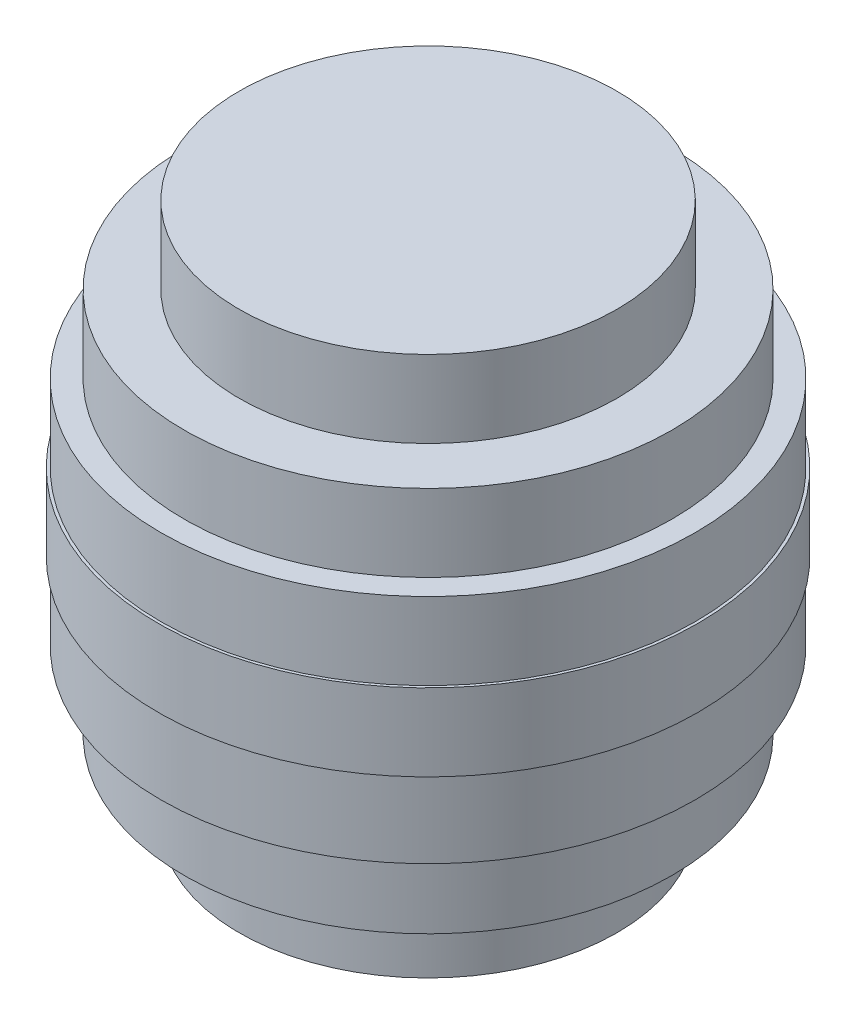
ISO-10303-21;
HEADER;
FILE_DESCRIPTION(('STEP AP214'),'2;1');
FILE_NAME('part.step','',(''),(''),'','','');
FILE_SCHEMA(('AUTOMOTIVE_DESIGN { 1 0 10303 214 1 1 1 1 }'));
ENDSEC;
DATA;
#1=APPLICATION_CONTEXT('core data for automotive mechanical design processes');
#2=APPLICATION_PROTOCOL_DEFINITION('international standard','automotive_design',2000,#1);
#3=PRODUCT_CONTEXT('',#1,'mechanical');
#4=PRODUCT('Part','Part','',(#3));
#5=PRODUCT_RELATED_PRODUCT_CATEGORY('part','',(#4));
#6=PRODUCT_DEFINITION_FORMATION('','',#4);
#7=PRODUCT_DEFINITION_CONTEXT('part definition',#1,'design');
#8=PRODUCT_DEFINITION('design','',#6,#7);
#9=PRODUCT_DEFINITION_SHAPE('','',#8);
#10=(LENGTH_UNIT() NAMED_UNIT(*) SI_UNIT(.MILLI.,.METRE.));
#11=(NAMED_UNIT(*) PLANE_ANGLE_UNIT() SI_UNIT($,.RADIAN.));
#12=(NAMED_UNIT(*) SI_UNIT($,.STERADIAN.) SOLID_ANGLE_UNIT());
#13=UNCERTAINTY_MEASURE_WITH_UNIT(LENGTH_MEASURE(1.E-05),#10,'distance_accuracy_value','');
#14=(GEOMETRIC_REPRESENTATION_CONTEXT(3) GLOBAL_UNCERTAINTY_ASSIGNED_CONTEXT((#13)) GLOBAL_UNIT_ASSIGNED_CONTEXT((#10,
#11,#12)) REPRESENTATION_CONTEXT('',''));
#15=CARTESIAN_POINT('',(0.,0.,0.));
#16=DIRECTION('',(0.,0.,1.));
#17=DIRECTION('',(1.,0.,0.));
#18=AXIS2_PLACEMENT_3D('',#15,#16,#17);
#19=CARTESIAN_POINT('',(17.3205080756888,2.49999999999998,0.));
#20=DIRECTION('',(0.,1.,0.));
#21=DIRECTION('',(-1.,0.,0.));
#22=AXIS2_PLACEMENT_3D('',#19,#20,#21);
#23=PLANE('',#22);
#24=CARTESIAN_POINT('',(0.,2.49999999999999,0.));
#25=DIRECTION('',(0.,-1.,0.));
#26=DIRECTION('',(1.,0.,0.));
#27=AXIS2_PLACEMENT_3D('',#24,#25,#26);
#28=CIRCLE('',#27,17.3205080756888);
#29=CARTESIAN_POINT('',(17.3205080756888,2.49999999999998,0.));
#30=VERTEX_POINT('',#29);
#31=EDGE_CURVE('E78',#30,#30,#28,.T.);
#32=ORIENTED_EDGE('',*,*,#31,.T.);
#33=EDGE_LOOP('',(#32));
#34=FACE_BOUND('',#33,.T.);
#35=CARTESIAN_POINT('',(0.,2.49999999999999,0.));
#36=DIRECTION('',(0.,-1.,0.));
#37=DIRECTION('',(1.,0.,0.));
#38=AXIS2_PLACEMENT_3D('',#35,#36,#37);
#39=CIRCLE('',#38,17.4999999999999);
#40=CARTESIAN_POINT('',(17.4999999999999,2.49999999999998,0.));
#41=VERTEX_POINT('',#40);
#42=EDGE_CURVE('E10',#41,#41,#39,.T.);
#43=ORIENTED_EDGE('',*,*,#42,.F.);
#44=EDGE_LOOP('',(#43));
#45=FACE_BOUND('',#44,.T.);
#46=ADVANCED_FACE('F32',(#34,#45),#23,.T.);
#47=CARTESIAN_POINT('',(0.,-17.5,0.));
#48=DIRECTION('',(0.,-1.,0.));
#49=DIRECTION('',(1.,0.,0.));
#50=AXIS2_PLACEMENT_3D('',#47,#48,#49);
#51=CYLINDRICAL_SURFACE('',#50,17.4999999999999);
#52=ORIENTED_EDGE('',*,*,#42,.T.);
#53=EDGE_LOOP('',(#52));
#54=FACE_BOUND('',#53,.T.);
#55=CARTESIAN_POINT('',(0.,-2.50000000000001,0.));
#56=DIRECTION('',(0.,-1.,0.));
#57=DIRECTION('',(1.,0.,0.));
#58=AXIS2_PLACEMENT_3D('',#55,#56,#57);
#59=CIRCLE('',#58,17.5);
#60=CARTESIAN_POINT('',(17.5,-2.50000000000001,0.));
#61=VERTEX_POINT('',#60);
#62=EDGE_CURVE('E38',#61,#61,#59,.T.);
#63=ORIENTED_EDGE('',*,*,#62,.F.);
#64=EDGE_LOOP('',(#63));
#65=FACE_BOUND('',#64,.T.);
#66=ADVANCED_FACE('F96',(#54,#65),#51,.T.);
#67=CARTESIAN_POINT('',(17.5,-2.50000000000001,0.));
#68=DIRECTION('',(0.,-1.,0.));
#69=DIRECTION('',(1.,0.,0.));
#70=AXIS2_PLACEMENT_3D('',#67,#68,#69);
#71=PLANE('',#70);
#72=ORIENTED_EDGE('',*,*,#62,.T.);
#73=EDGE_LOOP('',(#72));
#74=FACE_BOUND('',#73,.T.);
#75=CARTESIAN_POINT('',(0.,-2.50000000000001,0.));
#76=DIRECTION('',(0.,-1.,0.));
#77=DIRECTION('',(1.,0.,0.));
#78=AXIS2_PLACEMENT_3D('',#75,#76,#77);
#79=CIRCLE('',#78,17.3205080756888);
#80=CARTESIAN_POINT('',(17.3205080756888,-2.50000000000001,0.));
#81=VERTEX_POINT('',#80);
#82=EDGE_CURVE('E42',#81,#81,#79,.T.);
#83=ORIENTED_EDGE('',*,*,#82,.F.);
#84=EDGE_LOOP('',(#83));
#85=FACE_BOUND('',#84,.T.);
#86=ADVANCED_FACE('F100',(#74,#85),#71,.T.);
#87=CARTESIAN_POINT('',(0.,-17.5,0.));
#88=DIRECTION('',(0.,-1.,0.));
#89=DIRECTION('',(1.,0.,0.));
#90=AXIS2_PLACEMENT_3D('',#87,#88,#89);
#91=CYLINDRICAL_SURFACE('',#90,17.3205080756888);
#92=ORIENTED_EDGE('',*,*,#82,.T.);
#93=EDGE_LOOP('',(#92));
#94=FACE_BOUND('',#93,.T.);
#95=CARTESIAN_POINT('',(0.,-7.50000000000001,0.));
#96=DIRECTION('',(0.,-1.,0.));
#97=DIRECTION('',(1.,0.,0.));
#98=AXIS2_PLACEMENT_3D('',#95,#96,#97);
#99=CIRCLE('',#98,17.3205080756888);
#100=CARTESIAN_POINT('',(17.3205080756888,-7.50000000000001,0.));
#101=VERTEX_POINT('',#100);
#102=EDGE_CURVE('E46',#101,#101,#99,.T.);
#103=ORIENTED_EDGE('',*,*,#102,.F.);
#104=EDGE_LOOP('',(#103));
#105=FACE_BOUND('',#104,.T.);
#106=ADVANCED_FACE('F104',(#94,#105),#91,.T.);
#107=CARTESIAN_POINT('',(17.3205080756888,-7.50000000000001,0.));
#108=DIRECTION('',(0.,-1.,0.));
#109=DIRECTION('',(1.,0.,0.));
#110=AXIS2_PLACEMENT_3D('',#107,#108,#109);
#111=PLANE('',#110);
#112=ORIENTED_EDGE('',*,*,#102,.T.);
#113=EDGE_LOOP('',(#112));
#114=FACE_BOUND('',#113,.T.);
#115=CARTESIAN_POINT('',(0.,-7.50000000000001,0.));
#116=DIRECTION('',(0.,-1.,0.));
#117=DIRECTION('',(1.,0.,0.));
#118=AXIS2_PLACEMENT_3D('',#115,#116,#117);
#119=CIRCLE('',#118,15.8113883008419);
#120=CARTESIAN_POINT('',(15.8113883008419,-7.50000000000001,0.));
#121=VERTEX_POINT('',#120);
#122=EDGE_CURVE('E51',#121,#121,#119,.T.);
#123=ORIENTED_EDGE('',*,*,#122,.F.);
#124=EDGE_LOOP('',(#123));
#125=FACE_BOUND('',#124,.T.);
#126=ADVANCED_FACE('F110',(#114,#125),#111,.T.);
#127=CARTESIAN_POINT('',(0.,-17.5,0.));
#128=DIRECTION('',(0.,-1.,0.));
#129=DIRECTION('',(1.,0.,0.));
#130=AXIS2_PLACEMENT_3D('',#127,#128,#129);
#131=CYLINDRICAL_SURFACE('',#130,15.8113883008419);
#132=ORIENTED_EDGE('',*,*,#122,.T.);
#133=EDGE_LOOP('',(#132));
#134=FACE_BOUND('',#133,.T.);
#135=CARTESIAN_POINT('',(0.,-12.5,0.));
#136=DIRECTION('',(0.,-1.,0.));
#137=DIRECTION('',(1.,0.,0.));
#138=AXIS2_PLACEMENT_3D('',#135,#136,#137);
#139=CIRCLE('',#138,15.8113883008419);
#140=CARTESIAN_POINT('',(15.8113883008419,-12.5,0.));
#141=VERTEX_POINT('',#140);
#142=EDGE_CURVE('E54',#141,#141,#139,.T.);
#143=ORIENTED_EDGE('',*,*,#142,.F.);
#144=EDGE_LOOP('',(#143));
#145=FACE_BOUND('',#144,.T.);
#146=ADVANCED_FACE('F114',(#134,#145),#131,.T.);
#147=CARTESIAN_POINT('',(15.8113883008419,-12.5,0.));
#148=DIRECTION('',(0.,-1.,0.));
#149=DIRECTION('',(1.,0.,0.));
#150=AXIS2_PLACEMENT_3D('',#147,#148,#149);
#151=PLANE('',#150);
#152=ORIENTED_EDGE('',*,*,#142,.T.);
#153=EDGE_LOOP('',(#152));
#154=FACE_BOUND('',#153,.T.);
#155=CARTESIAN_POINT('',(0.,-12.5,0.));
#156=DIRECTION('',(0.,-1.,0.));
#157=DIRECTION('',(1.,0.,0.));
#158=AXIS2_PLACEMENT_3D('',#155,#156,#157);
#159=CIRCLE('',#158,12.2474487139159);
#160=CARTESIAN_POINT('',(12.2474487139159,-12.5,0.));
#161=VERTEX_POINT('',#160);
#162=EDGE_CURVE('E57',#161,#161,#159,.T.);
#163=ORIENTED_EDGE('',*,*,#162,.F.);
#164=EDGE_LOOP('',(#163));
#165=FACE_BOUND('',#164,.T.);
#166=ADVANCED_FACE('F118',(#154,#165),#151,.T.);
#167=CARTESIAN_POINT('',(0.,-17.5,0.));
#168=DIRECTION('',(0.,-1.,0.));
#169=DIRECTION('',(1.,0.,0.));
#170=AXIS2_PLACEMENT_3D('',#167,#168,#169);
#171=CYLINDRICAL_SURFACE('',#170,12.2474487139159);
#172=ORIENTED_EDGE('',*,*,#162,.T.);
#173=EDGE_LOOP('',(#172));
#174=FACE_BOUND('',#173,.T.);
#175=CARTESIAN_POINT('',(0.,-17.5,0.));
#176=DIRECTION('',(0.,-1.,0.));
#177=DIRECTION('',(1.,0.,0.));
#178=AXIS2_PLACEMENT_3D('',#175,#176,#177);
#179=CIRCLE('',#178,12.2474487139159);
#180=CARTESIAN_POINT('',(12.2474487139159,-17.5,0.));
#181=VERTEX_POINT('',#180);
#182=EDGE_CURVE('E60',#181,#181,#179,.T.);
#183=ORIENTED_EDGE('',*,*,#182,.F.);
#184=EDGE_LOOP('',(#183));
#185=FACE_BOUND('',#184,.T.);
#186=ADVANCED_FACE('F122',(#174,#185),#171,.T.);
#187=CARTESIAN_POINT('',(12.2474487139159,-17.5,0.));
#188=DIRECTION('',(0.,-1.,0.));
#189=DIRECTION('',(1.,0.,0.));
#190=AXIS2_PLACEMENT_3D('',#187,#188,#189);
#191=PLANE('',#190);
#192=ORIENTED_EDGE('',*,*,#182,.T.);
#193=EDGE_LOOP('',(#192));
#194=FACE_BOUND('',#193,.T.);
#195=ADVANCED_FACE('F126',(#194),#191,.T.);
#196=CARTESIAN_POINT('',(0.,17.5,0.));
#197=DIRECTION('',(0.,1.,0.));
#198=DIRECTION('',(-1.,0.,0.));
#199=AXIS2_PLACEMENT_3D('',#196,#197,#198);
#200=PLANE('',#199);
#201=CARTESIAN_POINT('',(0.,17.5,0.));
#202=DIRECTION('',(0.,-1.,0.));
#203=DIRECTION('',(1.,0.,0.));
#204=AXIS2_PLACEMENT_3D('',#201,#202,#203);
#205=CIRCLE('',#204,12.2474487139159);
#206=CARTESIAN_POINT('',(12.2474487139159,17.5,0.));
#207=VERTEX_POINT('',#206);
#208=EDGE_CURVE('E63',#207,#207,#205,.T.);
#209=ORIENTED_EDGE('',*,*,#208,.F.);
#210=EDGE_LOOP('',(#209));
#211=FACE_BOUND('',#210,.T.);
#212=ADVANCED_FACE('F130',(#211),#200,.T.);
#213=CARTESIAN_POINT('',(0.,-17.5,0.));
#214=DIRECTION('',(0.,-1.,0.));
#215=DIRECTION('',(1.,0.,0.));
#216=AXIS2_PLACEMENT_3D('',#213,#214,#215);
#217=CYLINDRICAL_SURFACE('',#216,12.2474487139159);
#218=ORIENTED_EDGE('',*,*,#208,.T.);
#219=EDGE_LOOP('',(#218));
#220=FACE_BOUND('',#219,.T.);
#221=CARTESIAN_POINT('',(0.,12.5,0.));
#222=DIRECTION('',(0.,-1.,0.));
#223=DIRECTION('',(1.,0.,0.));
#224=AXIS2_PLACEMENT_3D('',#221,#222,#223);
#225=CIRCLE('',#224,12.2474487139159);
#226=CARTESIAN_POINT('',(12.2474487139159,12.5,0.));
#227=VERTEX_POINT('',#226);
#228=EDGE_CURVE('E66',#227,#227,#225,.T.);
#229=ORIENTED_EDGE('',*,*,#228,.F.);
#230=EDGE_LOOP('',(#229));
#231=FACE_BOUND('',#230,.T.);
#232=ADVANCED_FACE('F134',(#220,#231),#217,.T.);
#233=CARTESIAN_POINT('',(12.2474487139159,12.5,0.));
#234=DIRECTION('',(0.,1.,0.));
#235=DIRECTION('',(-1.,0.,0.));
#236=AXIS2_PLACEMENT_3D('',#233,#234,#235);
#237=PLANE('',#236);
#238=ORIENTED_EDGE('',*,*,#228,.T.);
#239=EDGE_LOOP('',(#238));
#240=FACE_BOUND('',#239,.T.);
#241=CARTESIAN_POINT('',(0.,12.5,0.));
#242=DIRECTION('',(0.,-1.,0.));
#243=DIRECTION('',(1.,0.,0.));
#244=AXIS2_PLACEMENT_3D('',#241,#242,#243);
#245=CIRCLE('',#244,15.8113883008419);
#246=CARTESIAN_POINT('',(15.8113883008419,12.5,0.));
#247=VERTEX_POINT('',#246);
#248=EDGE_CURVE('E69',#247,#247,#245,.T.);
#249=ORIENTED_EDGE('',*,*,#248,.F.);
#250=EDGE_LOOP('',(#249));
#251=FACE_BOUND('',#250,.T.);
#252=ADVANCED_FACE('F138',(#240,#251),#237,.T.);
#253=CARTESIAN_POINT('',(0.,-17.5,0.));
#254=DIRECTION('',(0.,-1.,0.));
#255=DIRECTION('',(1.,0.,0.));
#256=AXIS2_PLACEMENT_3D('',#253,#254,#255);
#257=CYLINDRICAL_SURFACE('',#256,15.8113883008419);
#258=ORIENTED_EDGE('',*,*,#248,.T.);
#259=EDGE_LOOP('',(#258));
#260=FACE_BOUND('',#259,.T.);
#261=CARTESIAN_POINT('',(0.,7.49999999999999,0.));
#262=DIRECTION('',(0.,-1.,0.));
#263=DIRECTION('',(1.,0.,0.));
#264=AXIS2_PLACEMENT_3D('',#261,#262,#263);
#265=CIRCLE('',#264,15.8113883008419);
#266=CARTESIAN_POINT('',(15.8113883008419,7.49999999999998,0.));
#267=VERTEX_POINT('',#266);
#268=EDGE_CURVE('E72',#267,#267,#265,.T.);
#269=ORIENTED_EDGE('',*,*,#268,.F.);
#270=EDGE_LOOP('',(#269));
#271=FACE_BOUND('',#270,.T.);
#272=ADVANCED_FACE('F92',(#260,#271),#257,.T.);
#273=CARTESIAN_POINT('',(15.8113883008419,7.49999999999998,0.));
#274=DIRECTION('',(0.,1.,0.));
#275=DIRECTION('',(-1.,0.,0.));
#276=AXIS2_PLACEMENT_3D('',#273,#274,#275);
#277=PLANE('',#276);
#278=ORIENTED_EDGE('',*,*,#268,.T.);
#279=EDGE_LOOP('',(#278));
#280=FACE_BOUND('',#279,.T.);
#281=CARTESIAN_POINT('',(0.,7.49999999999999,0.));
#282=DIRECTION('',(0.,-1.,0.));
#283=DIRECTION('',(1.,0.,0.));
#284=AXIS2_PLACEMENT_3D('',#281,#282,#283);
#285=CIRCLE('',#284,17.3205080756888);
#286=CARTESIAN_POINT('',(17.3205080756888,7.49999999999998,0.));
#287=VERTEX_POINT('',#286);
#288=EDGE_CURVE('E75',#287,#287,#285,.T.);
#289=ORIENTED_EDGE('',*,*,#288,.F.);
#290=EDGE_LOOP('',(#289));
#291=FACE_BOUND('',#290,.T.);
#292=ADVANCED_FACE('F86',(#280,#291),#277,.T.);
#293=CARTESIAN_POINT('',(0.,-17.5,0.));
#294=DIRECTION('',(0.,-1.,0.));
#295=DIRECTION('',(1.,0.,0.));
#296=AXIS2_PLACEMENT_3D('',#293,#294,#295);
#297=CYLINDRICAL_SURFACE('',#296,17.3205080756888);
#298=ORIENTED_EDGE('',*,*,#288,.T.);
#299=EDGE_LOOP('',(#298));
#300=FACE_BOUND('',#299,.T.);
#301=ORIENTED_EDGE('',*,*,#31,.F.);
#302=EDGE_LOOP('',(#301));
#303=FACE_BOUND('',#302,.T.);
#304=ADVANCED_FACE('F84',(#300,#303),#297,.T.);
#305=CLOSED_SHELL('',(#46,#66,#86,#106,#126,#146,#166,#186,#195,#212,#232,#252,#272,#292,#304));
#306=MANIFOLD_SOLID_BREP('B2',#305);
#307=ADVANCED_BREP_SHAPE_REPRESENTATION('',(#18,#306),#14);
#308=SHAPE_DEFINITION_REPRESENTATION(#9,#307);
ENDSEC;
END-ISO-10303-21;
